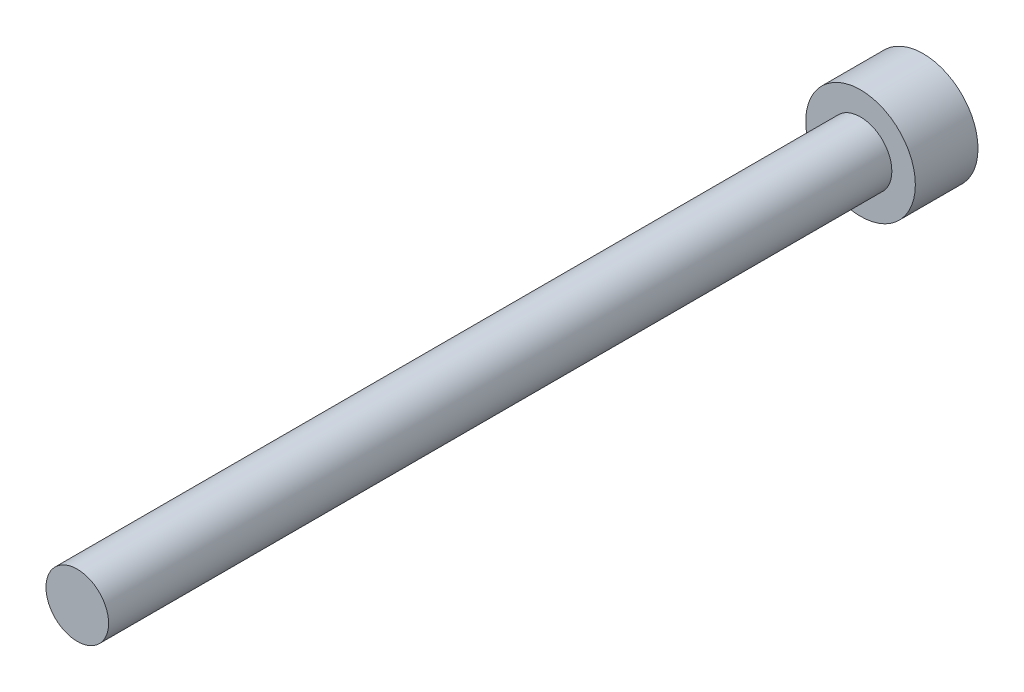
from build123d import *

# Parameters (mm, degrees)
HEX_2_DEPTH = 3


with BuildPart() as part:
    # Sketch6 → Revolve1 (revolve)
    with BuildSketch(Plane(origin=(0, 0, 0), x_dir=(0, 0, -1), z_dir=(1, 0, 0)), mode=Mode.PRIVATE) as revolve1_sk:
        Polygon((-50, 0), (-50, -2), (0, -2), (0, -3.5), (4, -3.5), (4, 0), align=None)
    revolve(revolve1_sk.sketch.rotate(Axis((0, 0, 50), (0, 0, -1)), 270), axis=Axis((0, 0, 50), (0, 0, -1)))

    # Sketch7 → HEX 2 (cut)
    with BuildSketch(Plane(origin=(0, 0, -4), x_dir=(-1, 0, 0), z_dir=(0, 0, -1))):
        Polygon((-1.5, 0.866025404), (-1.5, -0.866025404), (0, -1.732050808), (1.5, -0.866025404), (1.5, 0.866025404), (0, 1.732050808), align=None)
    extrude(amount=-HEX_2_DEPTH, mode=Mode.SUBTRACT)


solid = part.part
